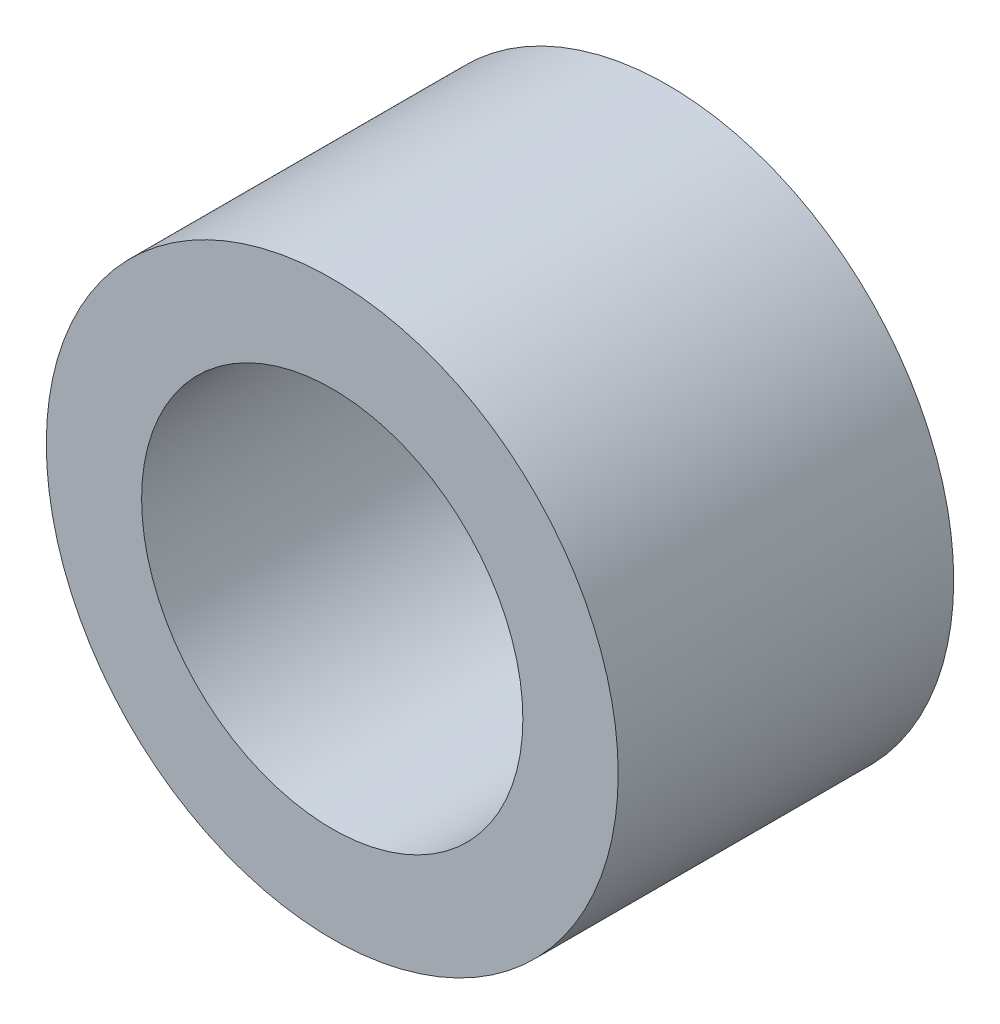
from build123d import *

# Parameters (mm, degrees)
SKETCH1_R          = 4.7625
SKETCH1_R_2        = 3.175
BASE_EXTRUDE_DEPTH = 5.588


with BuildPart() as part:
    # Sketch1 → Base-Extrude (new body)
    with BuildSketch(Plane.XY):
        Circle(SKETCH1_R)
        Circle(SKETCH1_R_2, mode=Mode.SUBTRACT)
    extrude(amount=BASE_EXTRUDE_DEPTH)


solid = part.part
